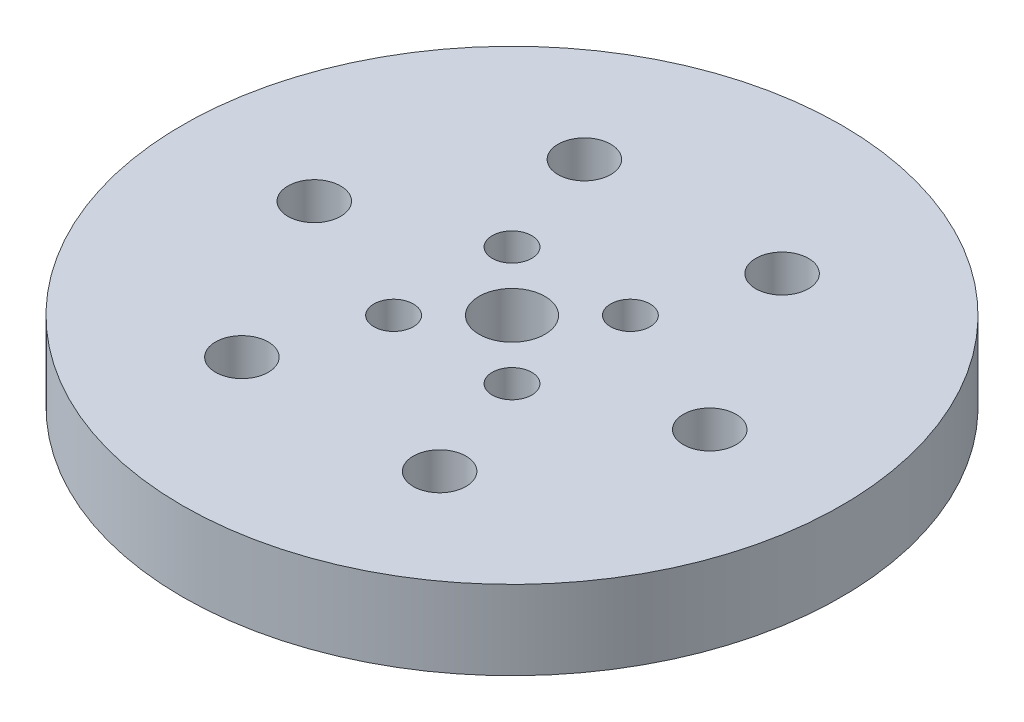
from build123d import *

# Parameters (mm, degrees)
SKETCH1_R           = 25
BOSS_EXTRUDE1_DEPTH = 6
SKETCH2_R           = 2.5
SKETCH2_R_2         = 1.5
HUB_MOUNTING_DEPTH  = 36.860842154
SKETCH3_R           = 2
DOWEL_HOLE_DEPTH    = 36.860842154
DOWEL_PATTERN_COUNT = 6


with BuildPart() as part:
    # Sketch1 → Boss-Extrude1 (new body)
    with BuildSketch(Plane(origin=(0, 0, 0), x_dir=(1, 0, 0), z_dir=(0, 1, 0))):
        with Locations(Location((0, 0, 0), (0, 0, 270))):
            Circle(SKETCH1_R)
    extrude(amount=BOSS_EXTRUDE1_DEPTH)

    # Sketch2 → hub mounting (cut, through all)
    with BuildSketch(Plane(origin=(0, 6, 0), x_dir=(1, 0, 0), z_dir=(0, 1, 0))):
        with Locations(Location((0, 0, 0), (0, 0, 270))):
            Circle(SKETCH2_R)
        with Locations(Location((-4.490128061, 4.490128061, 0), (0, 0, 270))):
            Circle(SKETCH2_R_2)
        with Locations(Location((4.490128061, 4.490128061, 0), (0, 0, 270))):
            Circle(SKETCH2_R_2)
        with Locations(Location((4.490128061, -4.490128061, 0), (0, 0, 270))):
            Circle(SKETCH2_R_2)
        with Locations(Location((-4.490128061, -4.490128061, 0), (0, 0, 270))):
            Circle(SKETCH2_R_2)
    extrude(amount=-HUB_MOUNTING_DEPTH, mode=Mode.SUBTRACT)

    # Sketch3 → dowel hole (cut, through all)
    with BuildSketch(Plane(origin=(0, 6, 0), x_dir=(1, 0, 0), z_dir=(0, 1, 0))):
        with Locations(Location((-15, 0, 0), (0, 0, 270))):
            Circle(SKETCH3_R)
    dowel_hole = extrude(amount=-DOWEL_HOLE_DEPTH, mode=Mode.SUBTRACT)

    # dowel pattern: dowel hole ×6 about axis
    dowel_pattern_axis = Axis((0, 0, 0), (0, 1, 0))
    for i in range(1, DOWEL_PATTERN_COUNT):
        add(dowel_hole.rotate(dowel_pattern_axis, i * 360 / DOWEL_PATTERN_COUNT), mode=Mode.SUBTRACT)


solid = part.part
